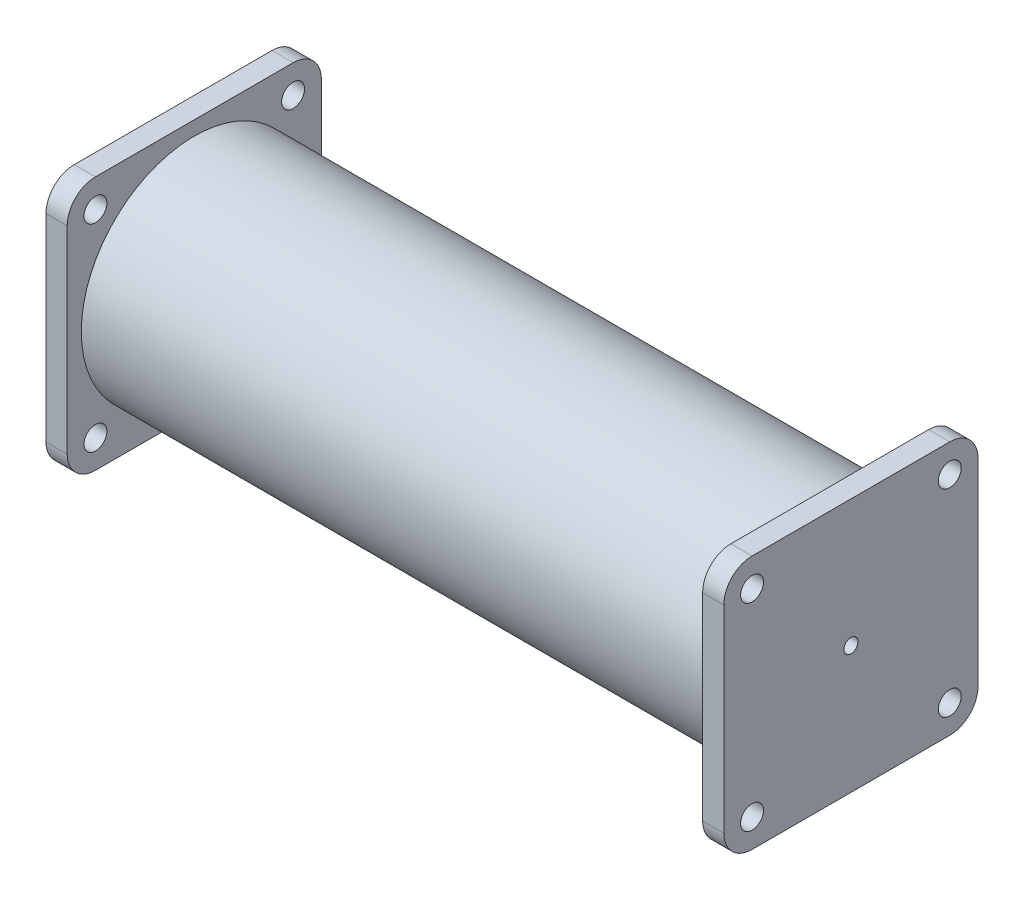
from build123d import *

# Parameters (mm, degrees)
SKETCH1_R               = 50.8
SKETCH1_R_2             = 45.0596
EXTRUDE1_DEPTH          = 146.05
SKETCH2_R               = 50.8
EXTRUDE2_DEPTH          = 6.35
SKETCH4_W               = 114.3
SKETCH4_H               = 114.3
EXTRUDE3_DEPTH          = 9.525
CUT_EXTRUDE1_DEPTH      = 508
CUT_EXTRUDE1_DEPTH_BACK = 316.333609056
SKETCH3_R               = 3.175
SKETCH5_R               = 5.1562
CUT_EXTRUDE2_DEPTH      = 316.333609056
FILLET1_R               = 12.7
FILLET2_R               = 12.7


with BuildPart() as part:
    # Sketch1 → Extrude1 (new, symmetric)
    with BuildSketch(Plane(origin=(0, 0, 0), x_dir=(0, 0, -1), z_dir=(1, 0, 0))):
        Circle(SKETCH1_R)
        Circle(SKETCH1_R_2, mode=Mode.SUBTRACT)
    extrude(amount=EXTRUDE1_DEPTH, both=True)

    # Sketch2 → Extrude2 (add)
    with BuildSketch(Plane.ZY.offset(146.05)):
        Circle(SKETCH2_R)
    extrude2 = extrude(amount=EXTRUDE2_DEPTH)

    # Sketch4 → Extrude3 (add)
    with BuildSketch(Plane.ZY.offset(152.4)):
        Rectangle(SKETCH4_W, SKETCH4_H)
    extrude3 = extrude(amount=-EXTRUDE3_DEPTH)

    # Mirror2: Extrude3 across plane
    add(extrude3.mirror(Plane(origin=(0, 0, 0), x_dir=(0, 0, 1), z_dir=(1, 0, 0))))

    # Mirror1: Extrude2 across plane
    add(extrude2.mirror(Plane(origin=(0, 0, 0), x_dir=(0, 0, 1), z_dir=(1, 0, 0))))

    # Sketch3 → Cut-Extrude1 (cut, two sides: drawn at the far end of the back side and taken through both)
    with BuildSketch(Plane.ZY.offset(152.4).offset(-CUT_EXTRUDE1_DEPTH_BACK)):
        Circle(SKETCH3_R)
    extrude(amount=CUT_EXTRUDE1_DEPTH + CUT_EXTRUDE1_DEPTH_BACK, mode=Mode.SUBTRACT)

    # Sketch5 → Cut-Extrude2 (cut, through all)
    with BuildSketch(Plane.ZY.offset(152.4)):
        with Locations((-44.45, 44.45)):
            Circle(SKETCH5_R)
        with Locations(Location((-44.45, -44.45, 0), (0, 0, 180))):
            Circle(SKETCH5_R)
        with Locations((44.45, -44.45)):
            Circle(SKETCH5_R)
        with Locations(Location((44.45, 44.45, 0), (0, 0, 180))):
            Circle(SKETCH5_R)
    extrude(amount=-CUT_EXTRUDE2_DEPTH, mode=Mode.SUBTRACT)

    # Fillet1
    fillet1_edges = [part.edges().sort_by_distance(p)[0] for p in [
        (-147.6375, -57.15, 57.15),
        (-147.6375, -57.15, -57.15),
        (-147.6375, 57.15, -57.15),
        (-147.6375, 57.15, 57.15),
    ]]
    fillet(fillet1_edges, radius=FILLET1_R)

    # Fillet2
    fillet2_edges = [part.edges().sort_by_distance(p)[0] for p in [
        (147.6375, -57.15, -57.15),
        (147.6375, -57.15, 57.15),
        (147.6375, 57.15, 57.15),
        (147.6375, 57.15, -57.15),
    ]]
    fillet(fillet2_edges, radius=FILLET2_R)


solid = part.part
